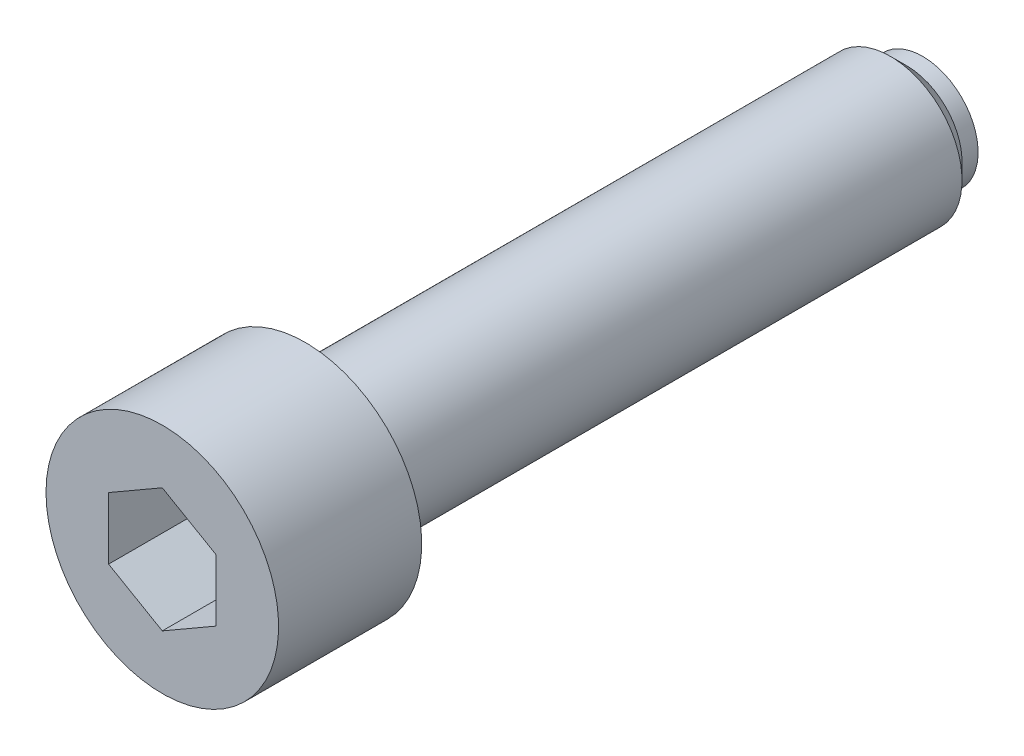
ISO-10303-21;
HEADER;
FILE_DESCRIPTION(('STEP AP214'),'2;1');
FILE_NAME('part.step','',(''),(''),'','','');
FILE_SCHEMA(('AUTOMOTIVE_DESIGN { 1 0 10303 214 1 1 1 1 }'));
ENDSEC;
DATA;
#1=APPLICATION_CONTEXT('core data for automotive mechanical design processes');
#2=APPLICATION_PROTOCOL_DEFINITION('international standard','automotive_design',2000,#1);
#3=PRODUCT_CONTEXT('',#1,'mechanical');
#4=PRODUCT('Part','Part','',(#3));
#5=PRODUCT_RELATED_PRODUCT_CATEGORY('part','',(#4));
#6=PRODUCT_DEFINITION_FORMATION('','',#4);
#7=PRODUCT_DEFINITION_CONTEXT('part definition',#1,'design');
#8=PRODUCT_DEFINITION('design','',#6,#7);
#9=PRODUCT_DEFINITION_SHAPE('','',#8);
#10=(LENGTH_UNIT() NAMED_UNIT(*) SI_UNIT(.MILLI.,.METRE.));
#11=(NAMED_UNIT(*) PLANE_ANGLE_UNIT() SI_UNIT($,.RADIAN.));
#12=(NAMED_UNIT(*) SI_UNIT($,.STERADIAN.) SOLID_ANGLE_UNIT());
#13=UNCERTAINTY_MEASURE_WITH_UNIT(LENGTH_MEASURE(1.E-05),#10,'distance_accuracy_value','');
#14=(GEOMETRIC_REPRESENTATION_CONTEXT(3) GLOBAL_UNCERTAINTY_ASSIGNED_CONTEXT((#13)) GLOBAL_UNIT_ASSIGNED_CONTEXT((#10,
#11,#12)) REPRESENTATION_CONTEXT('',''));
#15=CARTESIAN_POINT('',(0.,0.,0.));
#16=DIRECTION('',(0.,0.,1.));
#17=DIRECTION('',(1.,0.,0.));
#18=AXIS2_PLACEMENT_3D('',#15,#16,#17);
#19=CARTESIAN_POINT('',(0.,0.,0.));
#20=DIRECTION('',(0.,0.,-1.));
#21=DIRECTION('',(-1.,0.,0.));
#22=AXIS2_PLACEMENT_3D('',#19,#20,#21);
#23=PLANE('',#22);
#24=CARTESIAN_POINT('',(0.,0.,0.));
#25=DIRECTION('',(0.,0.,-1.));
#26=DIRECTION('',(-1.,0.,0.));
#27=AXIS2_PLACEMENT_3D('',#24,#25,#26);
#28=CIRCLE('',#27,2.25);
#29=CARTESIAN_POINT('',(-2.25000000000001,0.,0.));
#30=VERTEX_POINT('',#29);
#31=EDGE_CURVE('E131',#30,#30,#28,.T.);
#32=ORIENTED_EDGE('',*,*,#31,.T.);
#33=EDGE_LOOP('',(#32));
#34=FACE_BOUND('',#33,.T.);
#35=ADVANCED_FACE('F16',(#34),#23,.T.);
#36=CARTESIAN_POINT('',(-6.5,0.,43.));
#37=DIRECTION('',(0.,0.,1.));
#38=DIRECTION('',(1.,0.,0.));
#39=AXIS2_PLACEMENT_3D('',#36,#37,#38);
#40=PLANE('',#39);
#41=DIRECTION('',(-0.866025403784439,0.5,0.));
#42=VECTOR('',#41,1.);
#43=CARTESIAN_POINT('',(3.,1.73205080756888,43.));
#44=LINE('',#43,#42);
#45=CARTESIAN_POINT('',(3.,1.73205080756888,43.));
#46=VERTEX_POINT('',#45);
#47=CARTESIAN_POINT('',(0.,3.46410161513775,43.));
#48=VERTEX_POINT('',#47);
#49=EDGE_CURVE('E31',#46,#48,#44,.T.);
#50=ORIENTED_EDGE('',*,*,#49,.F.);
#51=DIRECTION('',(0.,1.,0.));
#52=VECTOR('',#51,1.);
#53=CARTESIAN_POINT('',(3.,-1.73205080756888,43.));
#54=LINE('',#53,#52);
#55=CARTESIAN_POINT('',(3.,-1.73205080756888,43.));
#56=VERTEX_POINT('',#55);
#57=EDGE_CURVE('E125',#56,#46,#54,.T.);
#58=ORIENTED_EDGE('',*,*,#57,.F.);
#59=DIRECTION('',(0.866025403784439,0.5,0.));
#60=VECTOR('',#59,1.);
#61=CARTESIAN_POINT('',(0.,-3.46410161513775,43.));
#62=LINE('',#61,#60);
#63=CARTESIAN_POINT('',(0.,-3.46410161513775,43.));
#64=VERTEX_POINT('',#63);
#65=EDGE_CURVE('E122',#64,#56,#62,.T.);
#66=ORIENTED_EDGE('',*,*,#65,.F.);
#67=DIRECTION('',(0.866025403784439,-0.5,0.));
#68=VECTOR('',#67,1.);
#69=CARTESIAN_POINT('',(-3.,-1.73205080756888,43.));
#70=LINE('',#69,#68);
#71=CARTESIAN_POINT('',(-3.,-1.73205080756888,43.));
#72=VERTEX_POINT('',#71);
#73=EDGE_CURVE('E79',#72,#64,#70,.T.);
#74=ORIENTED_EDGE('',*,*,#73,.F.);
#75=DIRECTION('',(0.,-1.,0.));
#76=VECTOR('',#75,1.);
#77=CARTESIAN_POINT('',(-3.,1.73205080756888,43.));
#78=LINE('',#77,#76);
#79=CARTESIAN_POINT('',(-3.,1.73205080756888,43.));
#80=VERTEX_POINT('',#79);
#81=EDGE_CURVE('E117',#80,#72,#78,.T.);
#82=ORIENTED_EDGE('',*,*,#81,.F.);
#83=DIRECTION('',(-0.866025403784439,-0.5,0.));
#84=VECTOR('',#83,1.);
#85=CARTESIAN_POINT('',(0.,3.46410161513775,43.));
#86=LINE('',#85,#84);
#87=EDGE_CURVE('E113',#48,#80,#86,.T.);
#88=ORIENTED_EDGE('',*,*,#87,.F.);
#89=EDGE_LOOP('',(#50,#58,#66,#74,#82,#88));
#90=FACE_BOUND('',#89,.T.);
#91=CARTESIAN_POINT('',(0.,0.,43.));
#92=DIRECTION('',(0.,0.,-1.));
#93=DIRECTION('',(-1.,0.,0.));
#94=AXIS2_PLACEMENT_3D('',#91,#92,#93);
#95=CIRCLE('',#94,6.5);
#96=CARTESIAN_POINT('',(-6.50000000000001,0.,43.));
#97=VERTEX_POINT('',#96);
#98=EDGE_CURVE('E10',#97,#97,#95,.T.);
#99=ORIENTED_EDGE('',*,*,#98,.F.);
#100=EDGE_LOOP('',(#99));
#101=FACE_BOUND('',#100,.T.);
#102=ADVANCED_FACE('F174',(#90,#101),#40,.T.);
#103=CARTESIAN_POINT('',(0.,0.,0.));
#104=DIRECTION('',(0.,0.,-1.));
#105=DIRECTION('',(-1.,0.,0.));
#106=AXIS2_PLACEMENT_3D('',#103,#104,#105);
#107=CYLINDRICAL_SURFACE('',#106,6.5);
#108=ORIENTED_EDGE('',*,*,#98,.T.);
#109=EDGE_LOOP('',(#108));
#110=FACE_BOUND('',#109,.T.);
#111=CARTESIAN_POINT('',(0.,0.,35.));
#112=DIRECTION('',(0.,0.,-1.));
#113=DIRECTION('',(-1.,0.,0.));
#114=AXIS2_PLACEMENT_3D('',#111,#112,#113);
#115=CIRCLE('',#114,6.5);
#116=CARTESIAN_POINT('',(-6.50000000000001,0.,35.));
#117=VERTEX_POINT('',#116);
#118=EDGE_CURVE('E24',#117,#117,#115,.T.);
#119=ORIENTED_EDGE('',*,*,#118,.F.);
#120=EDGE_LOOP('',(#119));
#121=FACE_BOUND('',#120,.T.);
#122=ADVANCED_FACE('F172',(#110,#121),#107,.T.);
#123=CARTESIAN_POINT('',(-4.,0.,35.));
#124=DIRECTION('',(0.,0.,-1.));
#125=DIRECTION('',(-1.,0.,0.));
#126=AXIS2_PLACEMENT_3D('',#123,#124,#125);
#127=PLANE('',#126);
#128=ORIENTED_EDGE('',*,*,#118,.T.);
#129=EDGE_LOOP('',(#128));
#130=FACE_BOUND('',#129,.T.);
#131=CARTESIAN_POINT('',(0.,0.,35.));
#132=DIRECTION('',(0.,0.,-1.));
#133=DIRECTION('',(-1.,0.,0.));
#134=AXIS2_PLACEMENT_3D('',#131,#132,#133);
#135=CIRCLE('',#134,4.);
#136=CARTESIAN_POINT('',(-4.00000000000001,0.,35.));
#137=VERTEX_POINT('',#136);
#138=EDGE_CURVE('E160',#137,#137,#135,.T.);
#139=ORIENTED_EDGE('',*,*,#138,.F.);
#140=EDGE_LOOP('',(#139));
#141=FACE_BOUND('',#140,.T.);
#142=ADVANCED_FACE('F169',(#130,#141),#127,.T.);
#143=CARTESIAN_POINT('',(0.,0.,0.));
#144=DIRECTION('',(0.,0.,-1.));
#145=DIRECTION('',(-1.,0.,0.));
#146=AXIS2_PLACEMENT_3D('',#143,#144,#145);
#147=CYLINDRICAL_SURFACE('',#146,4.);
#148=ORIENTED_EDGE('',*,*,#138,.T.);
#149=EDGE_LOOP('',(#148));
#150=FACE_BOUND('',#149,.T.);
#151=CARTESIAN_POINT('',(0.,0.,2.3));
#152=DIRECTION('',(0.,0.,-1.));
#153=DIRECTION('',(-1.,0.,0.));
#154=AXIS2_PLACEMENT_3D('',#151,#152,#153);
#155=CIRCLE('',#154,4.);
#156=CARTESIAN_POINT('',(-4.00000000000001,0.,2.3));
#157=VERTEX_POINT('',#156);
#158=EDGE_CURVE('E156',#157,#157,#155,.T.);
#159=ORIENTED_EDGE('',*,*,#158,.F.);
#160=EDGE_LOOP('',(#159));
#161=FACE_BOUND('',#160,.T.);
#162=ADVANCED_FACE('F183',(#150,#161),#147,.T.);
#163=CARTESIAN_POINT('',(0.,0.,1.4));
#164=DIRECTION('',(0.,0.,1.));
#165=DIRECTION('',(1.,0.,0.));
#166=AXIS2_PLACEMENT_3D('',#163,#164,#165);
#167=CONICAL_SURFACE('',#166,3.1,0.785398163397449);
#168=ORIENTED_EDGE('',*,*,#158,.T.);
#169=EDGE_LOOP('',(#168));
#170=FACE_BOUND('',#169,.T.);
#171=CARTESIAN_POINT('',(0.,0.,1.4));
#172=DIRECTION('',(0.,0.,-1.));
#173=DIRECTION('',(-1.,0.,0.));
#174=AXIS2_PLACEMENT_3D('',#171,#172,#173);
#175=CIRCLE('',#174,3.1);
#176=CARTESIAN_POINT('',(-3.10000000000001,0.,1.4));
#177=VERTEX_POINT('',#176);
#178=EDGE_CURVE('E152',#177,#177,#175,.T.);
#179=ORIENTED_EDGE('',*,*,#178,.F.);
#180=EDGE_LOOP('',(#179));
#181=FACE_BOUND('',#180,.T.);
#182=ADVANCED_FACE('F213',(#170,#181),#167,.T.);
#183=CARTESIAN_POINT('',(0.,0.,0.));
#184=DIRECTION('',(0.,0.,-1.));
#185=DIRECTION('',(-1.,0.,0.));
#186=AXIS2_PLACEMENT_3D('',#183,#184,#185);
#187=CYLINDRICAL_SURFACE('',#186,3.1);
#188=ORIENTED_EDGE('',*,*,#178,.T.);
#189=EDGE_LOOP('',(#188));
#190=FACE_BOUND('',#189,.T.);
#191=CARTESIAN_POINT('',(0.,0.,0.5));
#192=DIRECTION('',(0.,0.,-1.));
#193=DIRECTION('',(-1.,0.,0.));
#194=AXIS2_PLACEMENT_3D('',#191,#192,#193);
#195=CIRCLE('',#194,3.1);
#196=CARTESIAN_POINT('',(-3.10000000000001,0.,0.5));
#197=VERTEX_POINT('',#196);
#198=EDGE_CURVE('E148',#197,#197,#195,.T.);
#199=ORIENTED_EDGE('',*,*,#198,.F.);
#200=EDGE_LOOP('',(#199));
#201=FACE_BOUND('',#200,.T.);
#202=ADVANCED_FACE('F206',(#190,#201),#187,.T.);
#203=CARTESIAN_POINT('',(-2.52856457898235,0.,0.5));
#204=DIRECTION('',(0.,0.,-1.));
#205=DIRECTION('',(-1.,0.,0.));
#206=AXIS2_PLACEMENT_3D('',#203,#204,#205);
#207=PLANE('',#206);
#208=ORIENTED_EDGE('',*,*,#198,.T.);
#209=EDGE_LOOP('',(#208));
#210=FACE_BOUND('',#209,.T.);
#211=CARTESIAN_POINT('',(0.,0.,0.5));
#212=DIRECTION('',(0.,0.,-1.));
#213=DIRECTION('',(-1.,0.,0.));
#214=AXIS2_PLACEMENT_3D('',#211,#212,#213);
#215=CIRCLE('',#214,2.52856457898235);
#216=CARTESIAN_POINT('',(-2.52856457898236,0.,0.5));
#217=VERTEX_POINT('',#216);
#218=EDGE_CURVE('E144',#217,#217,#215,.T.);
#219=ORIENTED_EDGE('',*,*,#218,.F.);
#220=EDGE_LOOP('',(#219));
#221=FACE_BOUND('',#220,.T.);
#222=ADVANCED_FACE('F196',(#210,#221),#207,.T.);
#223=CARTESIAN_POINT('',(0.,0.,1.58113883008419));
#224=DIRECTION('',(0.,0.,-1.));
#225=DIRECTION('',(-1.,0.,0.));
#226=AXIS2_PLACEMENT_3D('',#223,#224,#225);
#227=SPHERICAL_SURFACE('',#226,2.75);
#228=CARTESIAN_POINT('',(-2.52856457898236,0.,0.5));
#229=CARTESIAN_POINT('',(-2.52621637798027,0.,0.494508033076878));
#230=CARTESIAN_POINT('',(-2.52385028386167,0.,0.489023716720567));
#231=CARTESIAN_POINT('',(-2.51908241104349,0.,0.478070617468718));
#232=CARTESIAN_POINT('',(-2.5166806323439,0.,0.472601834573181));
#233=CARTESIAN_POINT('',(-2.51184149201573,0.,0.461680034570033));
#234=CARTESIAN_POINT('',(-2.50940413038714,0.,0.456227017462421));
#235=CARTESIAN_POINT('',(-2.50449392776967,0.,0.445336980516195));
#236=CARTESIAN_POINT('',(-2.5020210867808,0.,0.43989996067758));
#237=CARTESIAN_POINT('',(-2.49704003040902,0.,0.429042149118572));
#238=CARTESIAN_POINT('',(-2.49453181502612,0.,0.42362135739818));
#239=CARTESIAN_POINT('',(-2.4894801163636,0.,0.41279623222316));
#240=CARTESIAN_POINT('',(-2.48693663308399,0.,0.407391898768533));
#241=CARTESIAN_POINT('',(-2.48181450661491,0.,0.396599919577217));
#242=CARTESIAN_POINT('',(-2.47923586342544,0.,0.391212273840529));
#243=CARTESIAN_POINT('',(-2.4740435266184,0.,0.380453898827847));
#244=CARTESIAN_POINT('',(-2.47142983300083,0.,0.375083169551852));
#245=CARTESIAN_POINT('',(-2.46616750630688,0.,0.364358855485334));
#246=CARTESIAN_POINT('',(-2.46351887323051,0.,0.35900527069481));
#247=CARTESIAN_POINT('',(-2.45818678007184,0.,0.348315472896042));
#248=CARTESIAN_POINT('',(-2.45550331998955,0.,0.342979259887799));
#249=CARTESIAN_POINT('',(-2.45010168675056,0.,0.332324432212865));
#250=CARTESIAN_POINT('',(-2.44738351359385,0.,0.327005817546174));
#251=CARTESIAN_POINT('',(-2.44191256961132,0.,0.316386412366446));
#252=CARTESIAN_POINT('',(-2.4391597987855,0.,0.311085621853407));
#253=CARTESIAN_POINT('',(-2.43361977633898,0.,0.300502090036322));
#254=CARTESIAN_POINT('',(-2.43083252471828,0.,0.295219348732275));
#255=CARTESIAN_POINT('',(-2.42522365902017,0.,0.284672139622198));
#256=CARTESIAN_POINT('',(-2.42240204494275,0.,0.279407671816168));
#257=CARTESIAN_POINT('',(-2.41672457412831,0.,0.268897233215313));
#258=CARTESIAN_POINT('',(-2.41386871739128,0.,0.263651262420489));
#259=CARTESIAN_POINT('',(-2.40812288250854,0.,0.253178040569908));
#260=CARTESIAN_POINT('',(-2.40523290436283,0.,0.247950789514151));
#261=CARTESIAN_POINT('',(-2.39941894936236,0.,0.237515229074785));
#262=CARTESIAN_POINT('',(-2.39649497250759,0.,0.232306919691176));
#263=CARTESIAN_POINT('',(-2.39061314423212,0.,0.221909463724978));
#264=CARTESIAN_POINT('',(-2.38765529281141,0.,0.21672031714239));
#265=CARTESIAN_POINT('',(-2.38170584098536,0.,0.206361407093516));
#266=CARTESIAN_POINT('',(-2.37871424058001,0.,0.201191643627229));
#267=CARTESIAN_POINT('',(-2.3726974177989,0.,0.190871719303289));
#268=CARTESIAN_POINT('',(-2.36967219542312,0.,0.185721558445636));
#269=CARTESIAN_POINT('',(-2.36358825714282,0.,0.175441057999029));
#270=CARTESIAN_POINT('',(-2.3605295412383,0.,0.170310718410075));
#271=CARTESIAN_POINT('',(-2.35437874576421,0.,0.160070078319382));
#272=CARTESIAN_POINT('',(-2.35128666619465,0.,0.154959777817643));
#273=CARTESIAN_POINT('',(-2.34506927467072,0.,0.144759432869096));
#274=CARTESIAN_POINT('',(-2.34194396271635,0.,0.139669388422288));
#275=CARTESIAN_POINT('',(-2.335660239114,0.,0.129509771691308));
#276=CARTESIAN_POINT('',(-2.33250182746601,0.,0.124440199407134));
#277=CARTESIAN_POINT('',(-2.32615203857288,0.,0.114321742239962));
#278=CARTESIAN_POINT('',(-2.32296066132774,0.,0.109272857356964));
#279=CARTESIAN_POINT('',(-2.31654507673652,0.,0.0991959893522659));
#280=CARTESIAN_POINT('',(-2.31332086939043,0.,0.0941680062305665));
#281=CARTESIAN_POINT('',(-2.30683976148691,0.,0.0841331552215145));
#282=CARTESIAN_POINT('',(-2.30358286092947,0.,0.0791262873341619));
#283=CARTESIAN_POINT('',(-2.29703650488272,0.,0.0691338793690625));
#284=CARTESIAN_POINT('',(-2.29374704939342,0.,0.0641483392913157));
#285=CARTESIAN_POINT('',(-2.28713572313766,0.,0.0541987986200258));
#286=CARTESIAN_POINT('',(-2.2838138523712,0.,0.0492347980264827));
#287=CARTESIAN_POINT('',(-2.27713783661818,0.,0.0393285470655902));
#288=CARTESIAN_POINT('',(-2.27378369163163,0.,0.0343862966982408));
#289=CARTESIAN_POINT('',(-2.26704326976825,0.,0.024523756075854));
#290=CARTESIAN_POINT('',(-2.26365699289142,0.,0.0196034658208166));
#291=CARTESIAN_POINT('',(-2.25685245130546,0.,0.00978505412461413));
#292=CARTESIAN_POINT('',(-2.25343418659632,0.,0.004886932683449));
#293=CARTESIAN_POINT('',(-2.25000000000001,0.,0.));
#294=B_SPLINE_CURVE_WITH_KNOTS('',3,(#228,#229,#230,#231,#232,#233,#234,#235,#236,#237,#238,
#239,#240,#241,#242,#243,#244,#245,#246,#247,#248,#249,#250,#251,#252,#253,#254,#255,#256,#257,
#258,#259,#260,#261,#262,#263,#264,#265,#266,#267,#268,#269,#270,#271,#272,#273,#274,#275,#276,
#277,#278,#279,#280,#281,#282,#283,#284,#285,#286,#287,#288,#289,#290,#291,#292,#293),
.UNSPECIFIED.,.F.,.F.,(4,2,2,2,2,2,2,2,2,2,2,2,2,2,2,2,2,2,2,2,2,2,2,2,2,2,2,2,2,2,2,2,4),(0.,
0.0179187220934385,0.035837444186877,0.0537561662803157,0.0716748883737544,0.0895936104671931,
0.107512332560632,0.12543105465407,0.143349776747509,0.161268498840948,0.179187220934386,
0.197105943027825,0.215024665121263,0.232943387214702,0.250862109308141,0.268780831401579,
0.286699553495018,0.304618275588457,0.322536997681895,0.340455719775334,0.358374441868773,
0.376293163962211,0.39421188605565,0.412130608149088,0.430049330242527,0.447968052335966,
0.465886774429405,0.483805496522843,0.501724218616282,0.519642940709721,0.537561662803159,
0.555480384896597,0.573399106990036),.UNSPECIFIED.);
#295=EDGE_CURVE('BSEAM193',#217,#30,#294,.T.);
#296=ORIENTED_EDGE('',*,*,#218,.T.);
#297=ORIENTED_EDGE('',*,*,#31,.F.);
#298=ORIENTED_EDGE('',*,*,#295,.T.);
#299=ORIENTED_EDGE('',*,*,#295,.F.);
#300=EDGE_LOOP('',(#296,#298,#297,#299));
#301=FACE_BOUND('',#300,.T.);
#302=ADVANCED_FACE('F193',(#301),#227,.T.);
#303=CARTESIAN_POINT('',(3.,1.73205080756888,38.));
#304=DIRECTION('',(0.5,0.866025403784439,0.));
#305=DIRECTION('',(-0.866025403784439,0.5,0.));
#306=AXIS2_PLACEMENT_3D('',#303,#304,#305);
#307=PLANE('',#306);
#308=ORIENTED_EDGE('',*,*,#49,.T.);
#309=DIRECTION('',(0.,0.,1.));
#310=VECTOR('',#309,1.);
#311=CARTESIAN_POINT('',(0.,3.46410161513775,38.));
#312=LINE('',#311,#310);
#313=CARTESIAN_POINT('',(0.,3.46410161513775,38.));
#314=VERTEX_POINT('',#313);
#315=EDGE_CURVE('E61',#314,#48,#312,.T.);
#316=ORIENTED_EDGE('',*,*,#315,.F.);
#317=DIRECTION('',(-0.866025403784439,0.5,0.));
#318=VECTOR('',#317,1.);
#319=CARTESIAN_POINT('',(3.,1.73205080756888,38.));
#320=LINE('',#319,#318);
#321=CARTESIAN_POINT('',(3.,1.73205080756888,38.));
#322=VERTEX_POINT('',#321);
#323=EDGE_CURVE('E128',#322,#314,#320,.T.);
#324=ORIENTED_EDGE('',*,*,#323,.F.);
#325=DIRECTION('',(0.,0.,1.));
#326=VECTOR('',#325,1.);
#327=CARTESIAN_POINT('',(3.,1.73205080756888,38.));
#328=LINE('',#327,#326);
#329=EDGE_CURVE('E39',#322,#46,#328,.T.);
#330=ORIENTED_EDGE('',*,*,#329,.T.);
#331=EDGE_LOOP('',(#308,#316,#324,#330));
#332=FACE_BOUND('',#331,.T.);
#333=ADVANCED_FACE('F195',(#332),#307,.F.);
#334=CARTESIAN_POINT('',(3.,-1.73205080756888,38.));
#335=DIRECTION('',(1.,0.,0.));
#336=DIRECTION('',(0.,0.,-1.));
#337=AXIS2_PLACEMENT_3D('',#334,#335,#336);
#338=PLANE('',#337);
#339=ORIENTED_EDGE('',*,*,#57,.T.);
#340=ORIENTED_EDGE('',*,*,#329,.F.);
#341=DIRECTION('',(0.,1.,0.));
#342=VECTOR('',#341,1.);
#343=CARTESIAN_POINT('',(3.,-1.73205080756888,38.));
#344=LINE('',#343,#342);
#345=CARTESIAN_POINT('',(3.,-1.73205080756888,38.));
#346=VERTEX_POINT('',#345);
#347=EDGE_CURVE('E93',#346,#322,#344,.T.);
#348=ORIENTED_EDGE('',*,*,#347,.F.);
#349=DIRECTION('',(0.,0.,1.));
#350=VECTOR('',#349,1.);
#351=CARTESIAN_POINT('',(3.,-1.73205080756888,38.));
#352=LINE('',#351,#350);
#353=EDGE_CURVE('E84',#346,#56,#352,.T.);
#354=ORIENTED_EDGE('',*,*,#353,.T.);
#355=EDGE_LOOP('',(#339,#340,#348,#354));
#356=FACE_BOUND('',#355,.T.);
#357=ADVANCED_FACE('F204',(#356),#338,.F.);
#358=CARTESIAN_POINT('',(0.,-3.46410161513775,38.));
#359=DIRECTION('',(0.5,-0.866025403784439,0.));
#360=DIRECTION('',(0.866025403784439,0.5,0.));
#361=AXIS2_PLACEMENT_3D('',#358,#359,#360);
#362=PLANE('',#361);
#363=ORIENTED_EDGE('',*,*,#65,.T.);
#364=ORIENTED_EDGE('',*,*,#353,.F.);
#365=DIRECTION('',(0.866025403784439,0.5,0.));
#366=VECTOR('',#365,1.);
#367=CARTESIAN_POINT('',(0.,-3.46410161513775,38.));
#368=LINE('',#367,#366);
#369=CARTESIAN_POINT('',(0.,-3.46410161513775,38.));
#370=VERTEX_POINT('',#369);
#371=EDGE_CURVE('E88',#370,#346,#368,.T.);
#372=ORIENTED_EDGE('',*,*,#371,.F.);
#373=DIRECTION('',(0.,0.,1.));
#374=VECTOR('',#373,1.);
#375=CARTESIAN_POINT('',(0.,-3.46410161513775,38.));
#376=LINE('',#375,#374);
#377=EDGE_CURVE('E72',#370,#64,#376,.T.);
#378=ORIENTED_EDGE('',*,*,#377,.T.);
#379=EDGE_LOOP('',(#363,#364,#372,#378));
#380=FACE_BOUND('',#379,.T.);
#381=ADVANCED_FACE('F89',(#380),#362,.F.);
#382=CARTESIAN_POINT('',(-3.,-1.73205080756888,38.));
#383=DIRECTION('',(-0.5,-0.866025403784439,0.));
#384=DIRECTION('',(0.866025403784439,-0.5,0.));
#385=AXIS2_PLACEMENT_3D('',#382,#383,#384);
#386=PLANE('',#385);
#387=ORIENTED_EDGE('',*,*,#73,.T.);
#388=ORIENTED_EDGE('',*,*,#377,.F.);
#389=DIRECTION('',(0.866025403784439,-0.5,0.));
#390=VECTOR('',#389,1.);
#391=CARTESIAN_POINT('',(-3.,-1.73205080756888,38.));
#392=LINE('',#391,#390);
#393=CARTESIAN_POINT('',(-3.,-1.73205080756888,38.));
#394=VERTEX_POINT('',#393);
#395=EDGE_CURVE('E76',#394,#370,#392,.T.);
#396=ORIENTED_EDGE('',*,*,#395,.F.);
#397=DIRECTION('',(0.,0.,1.));
#398=VECTOR('',#397,1.);
#399=CARTESIAN_POINT('',(-3.,-1.73205080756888,38.));
#400=LINE('',#399,#398);
#401=EDGE_CURVE('E85',#394,#72,#400,.T.);
#402=ORIENTED_EDGE('',*,*,#401,.T.);
#403=EDGE_LOOP('',(#387,#388,#396,#402));
#404=FACE_BOUND('',#403,.T.);
#405=ADVANCED_FACE('F74',(#404),#386,.F.);
#406=CARTESIAN_POINT('',(-3.,1.73205080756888,38.));
#407=DIRECTION('',(-1.,0.,0.));
#408=DIRECTION('',(0.,0.,1.));
#409=AXIS2_PLACEMENT_3D('',#406,#407,#408);
#410=PLANE('',#409);
#411=ORIENTED_EDGE('',*,*,#81,.T.);
#412=ORIENTED_EDGE('',*,*,#401,.F.);
#413=DIRECTION('',(0.,-1.,0.));
#414=VECTOR('',#413,1.);
#415=CARTESIAN_POINT('',(-3.,1.73205080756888,38.));
#416=LINE('',#415,#414);
#417=CARTESIAN_POINT('',(-3.,1.73205080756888,38.));
#418=VERTEX_POINT('',#417);
#419=EDGE_CURVE('E99',#418,#394,#416,.T.);
#420=ORIENTED_EDGE('',*,*,#419,.F.);
#421=DIRECTION('',(0.,0.,1.));
#422=VECTOR('',#421,1.);
#423=CARTESIAN_POINT('',(-3.,1.73205080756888,38.));
#424=LINE('',#423,#422);
#425=EDGE_CURVE('E136',#418,#80,#424,.T.);
#426=ORIENTED_EDGE('',*,*,#425,.T.);
#427=EDGE_LOOP('',(#411,#412,#420,#426));
#428=FACE_BOUND('',#427,.T.);
#429=ADVANCED_FACE('F306',(#428),#410,.F.);
#430=CARTESIAN_POINT('',(0.,3.46410161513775,38.));
#431=DIRECTION('',(-0.5,0.866025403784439,0.));
#432=DIRECTION('',(-0.866025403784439,-0.5,0.));
#433=AXIS2_PLACEMENT_3D('',#430,#431,#432);
#434=PLANE('',#433);
#435=ORIENTED_EDGE('',*,*,#87,.T.);
#436=ORIENTED_EDGE('',*,*,#425,.F.);
#437=DIRECTION('',(-0.866025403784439,-0.5,0.));
#438=VECTOR('',#437,1.);
#439=CARTESIAN_POINT('',(0.,3.46410161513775,38.));
#440=LINE('',#439,#438);
#441=EDGE_CURVE('E106',#314,#418,#440,.T.);
#442=ORIENTED_EDGE('',*,*,#441,.F.);
#443=ORIENTED_EDGE('',*,*,#315,.T.);
#444=EDGE_LOOP('',(#435,#436,#442,#443));
#445=FACE_BOUND('',#444,.T.);
#446=ADVANCED_FACE('F314',(#445),#434,.F.);
#447=CARTESIAN_POINT('',(0.,0.,38.));
#448=DIRECTION('',(0.,0.,1.));
#449=DIRECTION('',(1.,0.,0.));
#450=AXIS2_PLACEMENT_3D('',#447,#448,#449);
#451=PLANE('',#450);
#452=ORIENTED_EDGE('',*,*,#323,.T.);
#453=ORIENTED_EDGE('',*,*,#441,.T.);
#454=ORIENTED_EDGE('',*,*,#419,.T.);
#455=ORIENTED_EDGE('',*,*,#395,.T.);
#456=ORIENTED_EDGE('',*,*,#371,.T.);
#457=ORIENTED_EDGE('',*,*,#347,.T.);
#458=EDGE_LOOP('',(#452,#453,#454,#455,#456,#457));
#459=FACE_BOUND('',#458,.T.);
#460=ADVANCED_FACE('F96',(#459),#451,.T.);
#461=CLOSED_SHELL('',(#35,#102,#122,#142,#162,#182,#202,#222,#302,#333,#357,#381,#405,#429,#446,#460));
#462=MANIFOLD_SOLID_BREP('B1',#461);
#463=ADVANCED_BREP_SHAPE_REPRESENTATION('',(#18,#462),#14);
#464=SHAPE_DEFINITION_REPRESENTATION(#9,#463);
ENDSEC;
END-ISO-10303-21;
